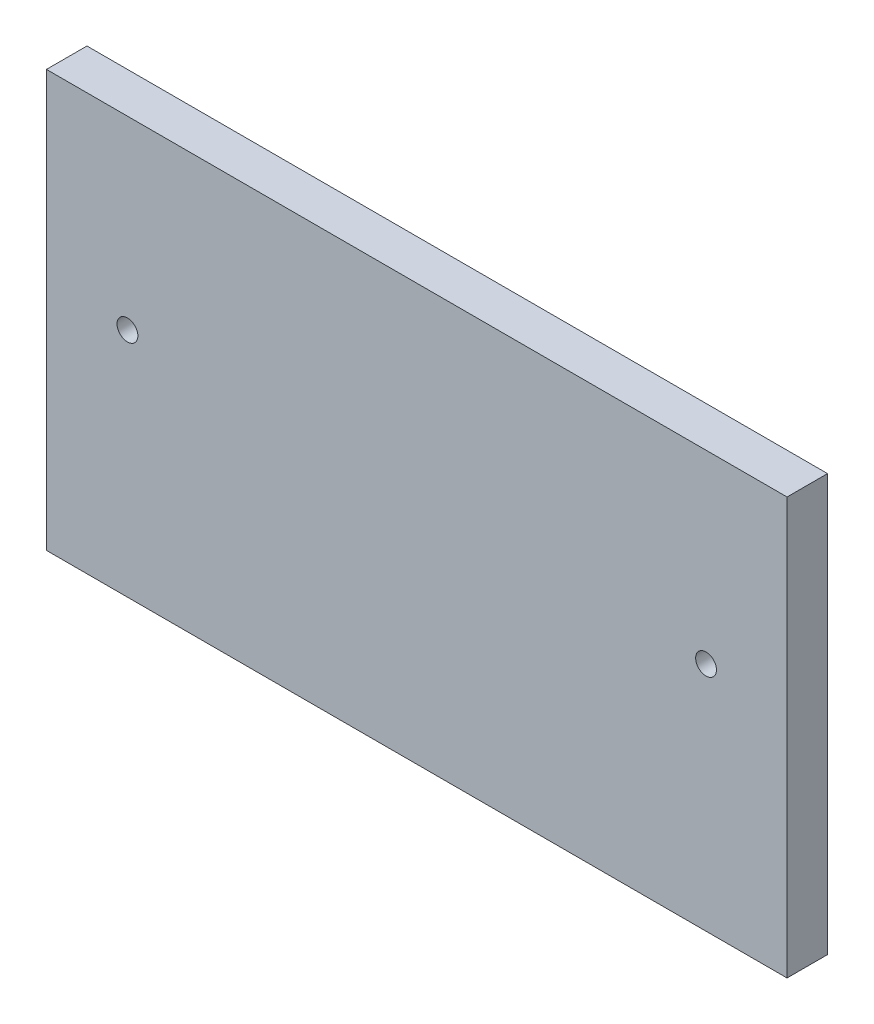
ISO-10303-21;
HEADER;
FILE_DESCRIPTION(('STEP AP214'),'2;1');
FILE_NAME('part.step','',(''),(''),'','','');
FILE_SCHEMA(('AUTOMOTIVE_DESIGN { 1 0 10303 214 1 1 1 1 }'));
ENDSEC;
DATA;
#1=APPLICATION_CONTEXT('core data for automotive mechanical design processes');
#2=APPLICATION_PROTOCOL_DEFINITION('international standard','automotive_design',2000,#1);
#3=PRODUCT_CONTEXT('',#1,'mechanical');
#4=PRODUCT('Part','Part','',(#3));
#5=PRODUCT_RELATED_PRODUCT_CATEGORY('part','',(#4));
#6=PRODUCT_DEFINITION_FORMATION('','',#4);
#7=PRODUCT_DEFINITION_CONTEXT('part definition',#1,'design');
#8=PRODUCT_DEFINITION('design','',#6,#7);
#9=PRODUCT_DEFINITION_SHAPE('','',#8);
#10=(LENGTH_UNIT() NAMED_UNIT(*) SI_UNIT(.MILLI.,.METRE.));
#11=(NAMED_UNIT(*) PLANE_ANGLE_UNIT() SI_UNIT($,.RADIAN.));
#12=(NAMED_UNIT(*) SI_UNIT($,.STERADIAN.) SOLID_ANGLE_UNIT());
#13=UNCERTAINTY_MEASURE_WITH_UNIT(LENGTH_MEASURE(1.E-05),#10,'distance_accuracy_value','');
#14=(GEOMETRIC_REPRESENTATION_CONTEXT(3) GLOBAL_UNCERTAINTY_ASSIGNED_CONTEXT((#13)) GLOBAL_UNIT_ASSIGNED_CONTEXT((#10,
#11,#12)) REPRESENTATION_CONTEXT('',''));
#15=CARTESIAN_POINT('',(0.,0.,0.));
#16=DIRECTION('',(0.,0.,1.));
#17=DIRECTION('',(1.,0.,0.));
#18=AXIS2_PLACEMENT_3D('',#15,#16,#17);
#19=CARTESIAN_POINT('',(0.,0.,35.));
#20=DIRECTION('',(0.,0.,1.));
#21=DIRECTION('',(1.,0.,0.));
#22=AXIS2_PLACEMENT_3D('',#19,#20,#21);
#23=PLANE('',#22);
#24=CARTESIAN_POINT('',(250.,20.,35.));
#25=DIRECTION('',(0.,0.,1.));
#26=DIRECTION('',(1.,0.,0.));
#27=AXIS2_PLACEMENT_3D('',#24,#25,#26);
#28=CIRCLE('',#27,9.);
#29=CARTESIAN_POINT('',(259.,20.,35.));
#30=VERTEX_POINT('',#29);
#31=EDGE_CURVE('E25',#30,#30,#28,.T.);
#32=ORIENTED_EDGE('',*,*,#31,.F.);
#33=EDGE_LOOP('',(#32));
#34=FACE_BOUND('',#33,.T.);
#35=CARTESIAN_POINT('',(-250.,20.,35.));
#36=DIRECTION('',(0.,0.,1.));
#37=DIRECTION('',(1.,0.,0.));
#38=AXIS2_PLACEMENT_3D('',#35,#36,#37);
#39=CIRCLE('',#38,9.);
#40=CARTESIAN_POINT('',(-241.,20.,35.));
#41=VERTEX_POINT('',#40);
#42=EDGE_CURVE('E73',#41,#41,#39,.T.);
#43=ORIENTED_EDGE('',*,*,#42,.F.);
#44=EDGE_LOOP('',(#43));
#45=FACE_BOUND('',#44,.T.);
#46=DIRECTION('',(1.,0.,0.));
#47=VECTOR('',#46,1.);
#48=CARTESIAN_POINT('',(-320.,-180.,35.));
#49=LINE('',#48,#47);
#50=CARTESIAN_POINT('',(-320.,-180.,35.));
#51=VERTEX_POINT('',#50);
#52=CARTESIAN_POINT('',(320.,-180.,35.));
#53=VERTEX_POINT('',#52);
#54=EDGE_CURVE('E185',#51,#53,#49,.T.);
#55=ORIENTED_EDGE('',*,*,#54,.T.);
#56=DIRECTION('',(0.,1.,0.));
#57=VECTOR('',#56,1.);
#58=CARTESIAN_POINT('',(320.,-180.,35.));
#59=LINE('',#58,#57);
#60=CARTESIAN_POINT('',(320.,180.,35.));
#61=VERTEX_POINT('',#60);
#62=EDGE_CURVE('E213',#53,#61,#59,.T.);
#63=ORIENTED_EDGE('',*,*,#62,.T.);
#64=DIRECTION('',(-1.,0.,0.));
#65=VECTOR('',#64,1.);
#66=CARTESIAN_POINT('',(320.,180.,35.));
#67=LINE('',#66,#65);
#68=CARTESIAN_POINT('',(-320.,180.,35.));
#69=VERTEX_POINT('',#68);
#70=EDGE_CURVE('E187',#61,#69,#67,.T.);
#71=ORIENTED_EDGE('',*,*,#70,.T.);
#72=DIRECTION('',(0.,-1.,0.));
#73=VECTOR('',#72,1.);
#74=CARTESIAN_POINT('',(-320.,180.,35.));
#75=LINE('',#74,#73);
#76=EDGE_CURVE('E85',#69,#51,#75,.T.);
#77=ORIENTED_EDGE('',*,*,#76,.T.);
#78=EDGE_LOOP('',(#55,#63,#71,#77));
#79=FACE_BOUND('',#78,.T.);
#80=ADVANCED_FACE('F16',(#34,#45,#79),#23,.T.);
#81=CARTESIAN_POINT('',(0.,0.,0.));
#82=DIRECTION('',(0.,0.,1.));
#83=DIRECTION('',(1.,0.,0.));
#84=AXIS2_PLACEMENT_3D('',#81,#82,#83);
#85=PLANE('',#84);
#86=CARTESIAN_POINT('',(250.,20.,0.));
#87=DIRECTION('',(0.,0.,1.));
#88=DIRECTION('',(1.,0.,0.));
#89=AXIS2_PLACEMENT_3D('',#86,#87,#88);
#90=CIRCLE('',#89,9.);
#91=CARTESIAN_POINT('',(259.,20.,0.));
#92=VERTEX_POINT('',#91);
#93=EDGE_CURVE('E10',#92,#92,#90,.T.);
#94=ORIENTED_EDGE('',*,*,#93,.T.);
#95=EDGE_LOOP('',(#94));
#96=FACE_BOUND('',#95,.T.);
#97=CARTESIAN_POINT('',(-250.,20.,0.));
#98=DIRECTION('',(0.,0.,1.));
#99=DIRECTION('',(1.,0.,0.));
#100=AXIS2_PLACEMENT_3D('',#97,#98,#99);
#101=CIRCLE('',#100,9.);
#102=CARTESIAN_POINT('',(-241.,20.,0.));
#103=VERTEX_POINT('',#102);
#104=EDGE_CURVE('E65',#103,#103,#101,.T.);
#105=ORIENTED_EDGE('',*,*,#104,.T.);
#106=EDGE_LOOP('',(#105));
#107=FACE_BOUND('',#106,.T.);
#108=DIRECTION('',(0.,-1.,0.));
#109=VECTOR('',#108,1.);
#110=CARTESIAN_POINT('',(-320.,180.,0.));
#111=LINE('',#110,#109);
#112=CARTESIAN_POINT('',(-320.,180.,0.));
#113=VERTEX_POINT('',#112);
#114=CARTESIAN_POINT('',(-320.,-180.,0.));
#115=VERTEX_POINT('',#114);
#116=EDGE_CURVE('E191',#113,#115,#111,.T.);
#117=ORIENTED_EDGE('',*,*,#116,.F.);
#118=DIRECTION('',(-1.,0.,0.));
#119=VECTOR('',#118,1.);
#120=CARTESIAN_POINT('',(320.,180.,0.));
#121=LINE('',#120,#119);
#122=CARTESIAN_POINT('',(320.,180.,0.));
#123=VERTEX_POINT('',#122);
#124=EDGE_CURVE('E220',#123,#113,#121,.T.);
#125=ORIENTED_EDGE('',*,*,#124,.F.);
#126=DIRECTION('',(0.,1.,0.));
#127=VECTOR('',#126,1.);
#128=CARTESIAN_POINT('',(320.,-180.,0.));
#129=LINE('',#128,#127);
#130=CARTESIAN_POINT('',(320.,-180.,0.));
#131=VERTEX_POINT('',#130);
#132=EDGE_CURVE('E197',#131,#123,#129,.T.);
#133=ORIENTED_EDGE('',*,*,#132,.F.);
#134=DIRECTION('',(1.,0.,0.));
#135=VECTOR('',#134,1.);
#136=CARTESIAN_POINT('',(-320.,-180.,0.));
#137=LINE('',#136,#135);
#138=EDGE_CURVE('E207',#115,#131,#137,.T.);
#139=ORIENTED_EDGE('',*,*,#138,.F.);
#140=EDGE_LOOP('',(#117,#125,#133,#139));
#141=FACE_BOUND('',#140,.T.);
#142=ADVANCED_FACE('F145',(#96,#107,#141),#85,.F.);
#143=CARTESIAN_POINT('',(250.,20.,0.));
#144=DIRECTION('',(0.,0.,-1.));
#145=DIRECTION('',(1.,0.,0.));
#146=AXIS2_PLACEMENT_3D('',#143,#144,#145);
#147=CYLINDRICAL_SURFACE('',#146,9.);
#148=DIRECTION('',(0.,0.,1.));
#149=VECTOR('',#148,1.);
#150=CARTESIAN_POINT('',(259.,20.,0.));
#151=LINE('',#150,#149);
#152=EDGE_CURVE('E83',#92,#30,#151,.T.);
#153=ORIENTED_EDGE('',*,*,#152,.T.);
#154=ORIENTED_EDGE('',*,*,#31,.T.);
#155=ORIENTED_EDGE('',*,*,#152,.F.);
#156=ORIENTED_EDGE('',*,*,#93,.F.);
#157=EDGE_LOOP('',(#153,#154,#155,#156));
#158=FACE_BOUND('',#157,.T.);
#159=ADVANCED_FACE('F137',(#158),#147,.F.);
#160=CARTESIAN_POINT('',(-250.,20.,0.));
#161=DIRECTION('',(0.,0.,-1.));
#162=DIRECTION('',(1.,0.,0.));
#163=AXIS2_PLACEMENT_3D('',#160,#161,#162);
#164=CYLINDRICAL_SURFACE('',#163,9.);
#165=DIRECTION('',(0.,0.,1.));
#166=VECTOR('',#165,1.);
#167=CARTESIAN_POINT('',(-241.,20.,0.));
#168=LINE('',#167,#166);
#169=EDGE_CURVE('E75',#103,#41,#168,.T.);
#170=ORIENTED_EDGE('',*,*,#169,.T.);
#171=ORIENTED_EDGE('',*,*,#42,.T.);
#172=ORIENTED_EDGE('',*,*,#169,.F.);
#173=ORIENTED_EDGE('',*,*,#104,.F.);
#174=EDGE_LOOP('',(#170,#171,#172,#173));
#175=FACE_BOUND('',#174,.T.);
#176=ADVANCED_FACE('F74',(#175),#164,.F.);
#177=CARTESIAN_POINT('',(-320.,180.,0.));
#178=DIRECTION('',(1.,0.,0.));
#179=DIRECTION('',(0.,1.,0.));
#180=AXIS2_PLACEMENT_3D('',#177,#178,#179);
#181=PLANE('',#180);
#182=ORIENTED_EDGE('',*,*,#116,.T.);
#183=DIRECTION('',(0.,0.,1.));
#184=VECTOR('',#183,1.);
#185=CARTESIAN_POINT('',(-320.,-180.,0.));
#186=LINE('',#185,#184);
#187=EDGE_CURVE('E193',#115,#51,#186,.T.);
#188=ORIENTED_EDGE('',*,*,#187,.T.);
#189=ORIENTED_EDGE('',*,*,#76,.F.);
#190=DIRECTION('',(0.,0.,1.));
#191=VECTOR('',#190,1.);
#192=CARTESIAN_POINT('',(-320.,180.,0.));
#193=LINE('',#192,#191);
#194=EDGE_CURVE('E221',#113,#69,#193,.T.);
#195=ORIENTED_EDGE('',*,*,#194,.F.);
#196=EDGE_LOOP('',(#182,#188,#189,#195));
#197=FACE_BOUND('',#196,.T.);
#198=ADVANCED_FACE('F96',(#197),#181,.F.);
#199=CARTESIAN_POINT('',(320.,180.,0.));
#200=DIRECTION('',(0.,-1.,0.));
#201=DIRECTION('',(0.,0.,-1.));
#202=AXIS2_PLACEMENT_3D('',#199,#200,#201);
#203=PLANE('',#202);
#204=ORIENTED_EDGE('',*,*,#124,.T.);
#205=ORIENTED_EDGE('',*,*,#194,.T.);
#206=ORIENTED_EDGE('',*,*,#70,.F.);
#207=DIRECTION('',(0.,0.,1.));
#208=VECTOR('',#207,1.);
#209=CARTESIAN_POINT('',(320.,180.,0.));
#210=LINE('',#209,#208);
#211=EDGE_CURVE('E211',#123,#61,#210,.T.);
#212=ORIENTED_EDGE('',*,*,#211,.F.);
#213=EDGE_LOOP('',(#204,#205,#206,#212));
#214=FACE_BOUND('',#213,.T.);
#215=ADVANCED_FACE('F101',(#214),#203,.F.);
#216=CARTESIAN_POINT('',(320.,-180.,0.));
#217=DIRECTION('',(-1.,0.,0.));
#218=DIRECTION('',(0.,0.,1.));
#219=AXIS2_PLACEMENT_3D('',#216,#217,#218);
#220=PLANE('',#219);
#221=ORIENTED_EDGE('',*,*,#132,.T.);
#222=ORIENTED_EDGE('',*,*,#211,.T.);
#223=ORIENTED_EDGE('',*,*,#62,.F.);
#224=DIRECTION('',(0.,0.,1.));
#225=VECTOR('',#224,1.);
#226=CARTESIAN_POINT('',(320.,-180.,0.));
#227=LINE('',#226,#225);
#228=EDGE_CURVE('E200',#131,#53,#227,.T.);
#229=ORIENTED_EDGE('',*,*,#228,.F.);
#230=EDGE_LOOP('',(#221,#222,#223,#229));
#231=FACE_BOUND('',#230,.T.);
#232=ADVANCED_FACE('F114',(#231),#220,.F.);
#233=CARTESIAN_POINT('',(-320.,-180.,0.));
#234=DIRECTION('',(0.,1.,0.));
#235=DIRECTION('',(1.,0.,0.));
#236=AXIS2_PLACEMENT_3D('',#233,#234,#235);
#237=PLANE('',#236);
#238=ORIENTED_EDGE('',*,*,#138,.T.);
#239=ORIENTED_EDGE('',*,*,#228,.T.);
#240=ORIENTED_EDGE('',*,*,#54,.F.);
#241=ORIENTED_EDGE('',*,*,#187,.F.);
#242=EDGE_LOOP('',(#238,#239,#240,#241));
#243=FACE_BOUND('',#242,.T.);
#244=ADVANCED_FACE('F109',(#243),#237,.F.);
#245=CLOSED_SHELL('',(#80,#142,#159,#176,#198,#215,#232,#244));
#246=MANIFOLD_SOLID_BREP('B1',#245);
#247=ADVANCED_BREP_SHAPE_REPRESENTATION('',(#18,#246),#14);
#248=SHAPE_DEFINITION_REPRESENTATION(#9,#247);
ENDSEC;
END-ISO-10303-21;
